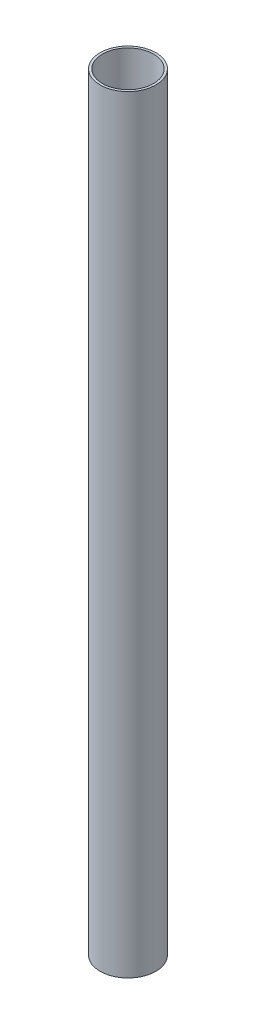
from build123d import *

# Parameters (mm, degrees)
SKETCH1_R           = 12
SKETCH1_R_2         = 11
BOSS_EXTRUDE1_DEPTH = 330


with BuildPart() as part:
    # Sketch1 → Boss-Extrude1 (new body)
    with BuildSketch(Plane(origin=(0, 0, 0), x_dir=(1, 0, 0), z_dir=(0, 1, 0))):
        with Locations(Location((0, 0, 0), (0, 0, 270))):
            Circle(SKETCH1_R)
        with Locations(Location((0, 0, 0), (0, 0, 270))):
            Circle(SKETCH1_R_2, mode=Mode.SUBTRACT)
    extrude(amount=-BOSS_EXTRUDE1_DEPTH)


solid = part.part
